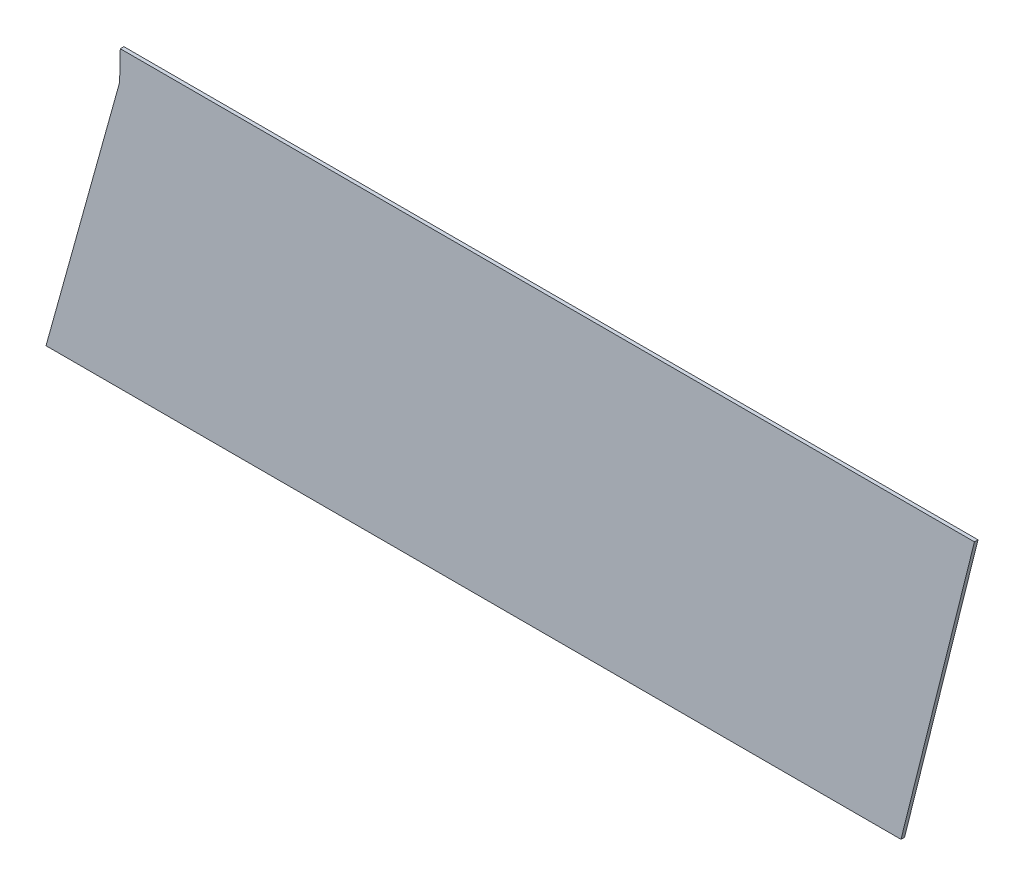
from build123d import *

# Parameters (mm, degrees)
BASE_EXTRUSION_DEPTH = 5


with BuildPart() as part:
    # Esquisse1 → Base-Extrusion (new body)
    with BuildSketch(Plane.XY):
        Polygon((1196.564064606, 4350.852921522), (103.946267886, 4350.852921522), (103.021615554, 4309.504318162), (0, 3938.852921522), (1196.564064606, 3938.852921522), (1299.330387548, 4350.852921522), align=None)
    extrude(amount=BASE_EXTRUSION_DEPTH)


solid = part.part
